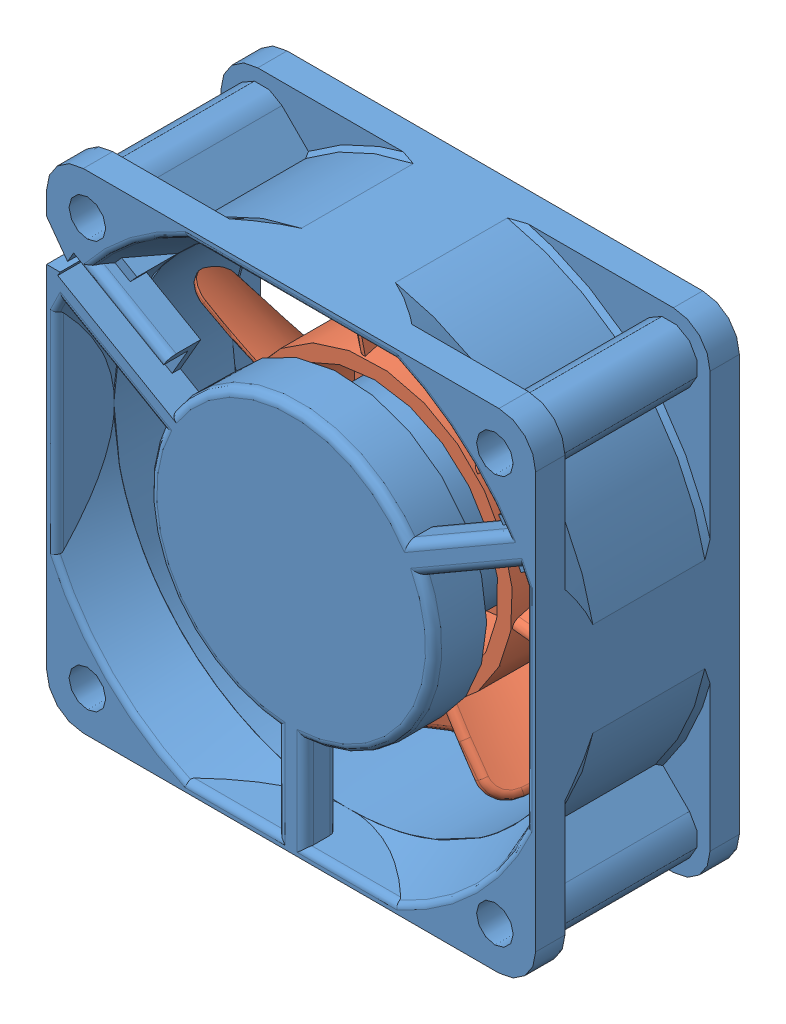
SolidWorks assembly User Library-fan 60x60x25 mm.SLDASM, configuration Default (file format 5000). Lengths in mm.
Overall size (77.36 76.7 27.22).
2 component instances, 2 part files, 2 mates.
Components (placement in the parent):
- User Library-fan 60x60x25 mm_Carcasa Ventilador 60x60-1: User Library-fan 60x60x25 mm_Carcasa Ventilador 60x60.SLDPRT [Default] at (5.1234 -0.8457 -14.6488) size (60 60 25.97)
- User Library-fan 60x60x25 mm_Alaves Ventilador 60x60-1: User Library-fan 60x60x25 mm_Alaves Ventilador 60x60.SLDPRT [Default] at (5.1234 -0.8457 0.3512) x (-0.902296 0.431117 0) z (0 0 -1) size (58.47 57.07 16.94)
Mates (geometry in assembly coordinates):
- Concéntrica1: concentric anti-aligned: circle of User Library-fan 60x60x25 mm_Carcasa Ventilador 60x60-1; circle of User Library-fan 60x60x25 mm_Alaves Ventilador 60x60-1
- Coincidente2: coincident aligned: plane of User Library-fan 60x60x25 mm_Carcasa Ventilador 60x60-1 through (-20.3766 24.6543 -14.6488) normal (0 0 -1); plane of User Library-fan 60x60x25 mm_Alaves Ventilador 60x60-1 through (5.1234 -0.8457 -14.6488) normal (0 0 -1)
